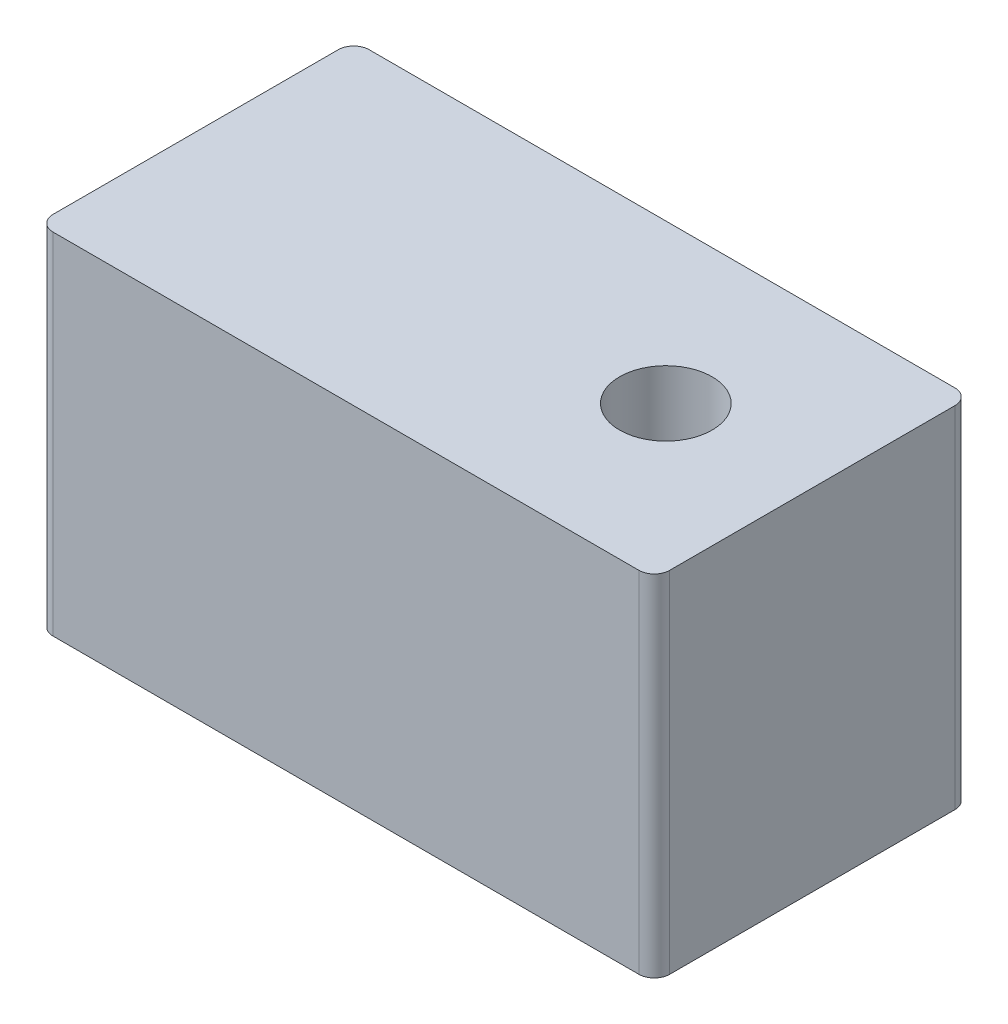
from build123d import *

# Parameters (mm, degrees)
Z_KLAD_PROTA_EN_DEPTH    = 22.7
SKICA2_R                 = 3
ODEBRAT_VYSUNUT_M1_DEPTH = 10


with BuildPart() as part:
    # Skica1 → Z_klad-Prota_en (new body)
    with BuildSketch(Plane(origin=(0, 0, 0), x_dir=(1, 0, 0), z_dir=(0, 1, 0))):
        with BuildLine():
            Line((-19, 10.25), (19, 10.25))
            ThreePointArc((19, 10.25), (19.707106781, 9.957106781), (20, 9.25))
            Line((20, 9.25), (20, -9.25))
            ThreePointArc((20, -9.25), (19.707106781, -9.957106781), (19, -10.25))
            Line((19, -10.25), (-19, -10.25))
            ThreePointArc((-19, -10.25), (-19.707106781, -9.957106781), (-20, -9.25))
            Line((-20, -9.25), (-20, 9.25))
            ThreePointArc((-20, 9.25), (-19.707106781, 9.957106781), (-19, 10.25))
        make_face()
    extrude(amount=Z_KLAD_PROTA_EN_DEPTH)

    # Skica2 → Odebrat vysunut_m1 (cut)
    with BuildSketch(Plane(origin=(0, 22.7, 0), x_dir=(-1, 0, 0), z_dir=(0, 1, 0))):
        with Locations(Location((-10.5, 0, 0), (0, 0, 90))):
            Circle(SKICA2_R)
    extrude(amount=-ODEBRAT_VYSUNUT_M1_DEPTH, mode=Mode.SUBTRACT)


solid = part.part
